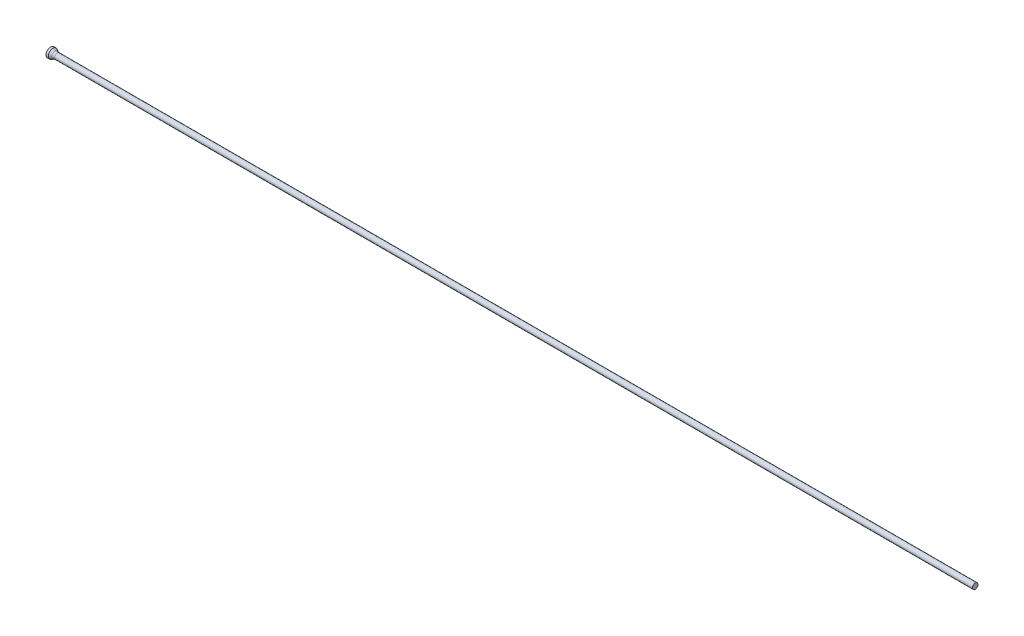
ISO-10303-21;
HEADER;
FILE_DESCRIPTION(('STEP AP214'),'2;1');
FILE_NAME('part.step','',(''),(''),'','','');
FILE_SCHEMA(('AUTOMOTIVE_DESIGN { 1 0 10303 214 1 1 1 1 }'));
ENDSEC;
DATA;
#1=APPLICATION_CONTEXT('core data for automotive mechanical design processes');
#2=APPLICATION_PROTOCOL_DEFINITION('international standard','automotive_design',2000,#1);
#3=PRODUCT_CONTEXT('',#1,'mechanical');
#4=PRODUCT('Part','Part','',(#3));
#5=PRODUCT_RELATED_PRODUCT_CATEGORY('part','',(#4));
#6=PRODUCT_DEFINITION_FORMATION('','',#4);
#7=PRODUCT_DEFINITION_CONTEXT('part definition',#1,'design');
#8=PRODUCT_DEFINITION('design','',#6,#7);
#9=PRODUCT_DEFINITION_SHAPE('','',#8);
#10=(LENGTH_UNIT() NAMED_UNIT(*) SI_UNIT(.MILLI.,.METRE.));
#11=(NAMED_UNIT(*) PLANE_ANGLE_UNIT() SI_UNIT($,.RADIAN.));
#12=(NAMED_UNIT(*) SI_UNIT($,.STERADIAN.) SOLID_ANGLE_UNIT());
#13=UNCERTAINTY_MEASURE_WITH_UNIT(LENGTH_MEASURE(1.E-05),#10,'distance_accuracy_value','');
#14=(GEOMETRIC_REPRESENTATION_CONTEXT(3) GLOBAL_UNCERTAINTY_ASSIGNED_CONTEXT((#13)) GLOBAL_UNIT_ASSIGNED_CONTEXT((#10,
#11,#12)) REPRESENTATION_CONTEXT('',''));
#15=CARTESIAN_POINT('',(0.,0.,0.));
#16=DIRECTION('',(0.,0.,1.));
#17=DIRECTION('',(1.,0.,0.));
#18=AXIS2_PLACEMENT_3D('',#15,#16,#17);
#19=CARTESIAN_POINT('',(0.,0.,0.));
#20=DIRECTION('',(1.,0.,0.));
#21=DIRECTION('',(0.,0.,-1.));
#22=AXIS2_PLACEMENT_3D('',#19,#20,#21);
#23=PLANE('',#22);
#24=CARTESIAN_POINT('',(0.,0.,0.));
#25=DIRECTION('',(-1.,0.,0.));
#26=DIRECTION('',(0.,0.,1.));
#27=AXIS2_PLACEMENT_3D('',#24,#25,#26);
#28=CIRCLE('',#27,1.);
#29=CARTESIAN_POINT('',(0.,0.,1.));
#30=VERTEX_POINT('',#29);
#31=EDGE_CURVE('E25',#30,#30,#28,.T.);
#32=ORIENTED_EDGE('',*,*,#31,.T.);
#33=EDGE_LOOP('',(#32));
#34=FACE_BOUND('',#33,.T.);
#35=ADVANCED_FACE('F14',(#34),#23,.F.);
#36=CARTESIAN_POINT('',(0.,0.,0.));
#37=DIRECTION('',(-1.,0.,0.));
#38=DIRECTION('',(0.,0.,1.));
#39=AXIS2_PLACEMENT_3D('',#36,#37,#38);
#40=CYLINDRICAL_SURFACE('',#39,1.);
#41=ORIENTED_EDGE('',*,*,#31,.F.);
#42=EDGE_LOOP('',(#41));
#43=FACE_BOUND('',#42,.T.);
#44=CARTESIAN_POINT('',(0.497179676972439,0.,0.));
#45=DIRECTION('',(-1.,0.,0.));
#46=DIRECTION('',(0.,0.,1.));
#47=AXIS2_PLACEMENT_3D('',#44,#45,#46);
#48=CIRCLE('',#47,1.);
#49=CARTESIAN_POINT('',(0.497179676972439,0.,1.));
#50=VERTEX_POINT('',#49);
#51=EDGE_CURVE('E29',#50,#50,#48,.T.);
#52=ORIENTED_EDGE('',*,*,#51,.T.);
#53=EDGE_LOOP('',(#52));
#54=FACE_BOUND('',#53,.T.);
#55=ADVANCED_FACE('F53',(#43,#54),#40,.T.);
#56=CARTESIAN_POINT('',(1.19,0.,0.));
#57=DIRECTION('',(-1.,0.,0.));
#58=DIRECTION('',(0.,0.,1.));
#59=AXIS2_PLACEMENT_3D('',#56,#57,#58);
#60=CONICAL_SURFACE('',#59,0.6,0.523598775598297);
#61=CARTESIAN_POINT('',(0.957949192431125,0.,0.));
#62=DIRECTION('',(-1.,0.,0.));
#63=DIRECTION('',(0.,0.,1.));
#64=AXIS2_PLACEMENT_3D('',#61,#62,#63);
#65=CIRCLE('',#64,0.733974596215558);
#66=CARTESIAN_POINT('',(0.957949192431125,0.,0.733974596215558));
#67=VERTEX_POINT('',#66);
#68=EDGE_CURVE('E21',#67,#67,#65,.T.);
#69=ORIENTED_EDGE('',*,*,#68,.T.);
#70=EDGE_LOOP('',(#69));
#71=FACE_BOUND('',#70,.T.);
#72=ORIENTED_EDGE('',*,*,#51,.F.);
#73=EDGE_LOOP('',(#72));
#74=FACE_BOUND('',#73,.T.);
#75=ADVANCED_FACE('F50',(#71,#74),#60,.T.);
#76=CARTESIAN_POINT('',(0.,0.,0.));
#77=DIRECTION('',(-1.,0.,0.));
#78=DIRECTION('',(0.,0.,1.));
#79=AXIS2_PLACEMENT_3D('',#76,#77,#78);
#80=CYLINDRICAL_SURFACE('',#79,0.6);
#81=CARTESIAN_POINT('',(1.45794919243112,0.,0.));
#82=DIRECTION('',(-1.,0.,0.));
#83=DIRECTION('',(0.,0.,1.));
#84=AXIS2_PLACEMENT_3D('',#81,#82,#83);
#85=CIRCLE('',#84,0.6);
#86=CARTESIAN_POINT('',(1.45794919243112,0.,0.6));
#87=VERTEX_POINT('',#86);
#88=EDGE_CURVE('E9',#87,#87,#85,.F.);
#89=ORIENTED_EDGE('',*,*,#88,.T.);
#90=EDGE_LOOP('',(#89));
#91=FACE_BOUND('',#90,.T.);
#92=CARTESIAN_POINT('',(200.,0.,0.));
#93=DIRECTION('',(-1.,0.,0.));
#94=DIRECTION('',(0.,0.,1.));
#95=AXIS2_PLACEMENT_3D('',#92,#93,#94);
#96=CIRCLE('',#95,0.6);
#97=CARTESIAN_POINT('',(200.,0.,0.6));
#98=VERTEX_POINT('',#97);
#99=EDGE_CURVE('E34',#98,#98,#96,.T.);
#100=ORIENTED_EDGE('',*,*,#99,.T.);
#101=EDGE_LOOP('',(#100));
#102=FACE_BOUND('',#101,.T.);
#103=ADVANCED_FACE('F38',(#91,#102),#80,.T.);
#104=CARTESIAN_POINT('',(200.,0.6,0.));
#105=DIRECTION('',(-1.,0.,0.));
#106=DIRECTION('',(0.,0.,1.));
#107=AXIS2_PLACEMENT_3D('',#104,#105,#106);
#108=PLANE('',#107);
#109=ORIENTED_EDGE('',*,*,#99,.F.);
#110=EDGE_LOOP('',(#109));
#111=FACE_BOUND('',#110,.T.);
#112=ADVANCED_FACE('F40',(#111),#108,.F.);
#113=CARTESIAN_POINT('',(1.45794919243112,0.,0.));
#114=DIRECTION('',(-1.,0.,0.));
#115=DIRECTION('',(0.,0.,1.));
#116=AXIS2_PLACEMENT_3D('',#113,#114,#115);
#117=TOROIDAL_SURFACE('',#116,1.6,1.);
#118=ORIENTED_EDGE('',*,*,#88,.F.);
#119=EDGE_LOOP('',(#118));
#120=FACE_BOUND('',#119,.T.);
#121=ORIENTED_EDGE('',*,*,#68,.F.);
#122=EDGE_LOOP('',(#121));
#123=FACE_BOUND('',#122,.T.);
#124=ADVANCED_FACE('F16',(#120,#123),#117,.F.);
#125=CLOSED_SHELL('',(#35,#55,#75,#103,#112,#124));
#126=MANIFOLD_SOLID_BREP('B1',#125);
#127=ADVANCED_BREP_SHAPE_REPRESENTATION('',(#18,#126),#14);
#128=SHAPE_DEFINITION_REPRESENTATION(#9,#127);
ENDSEC;
END-ISO-10303-21;
